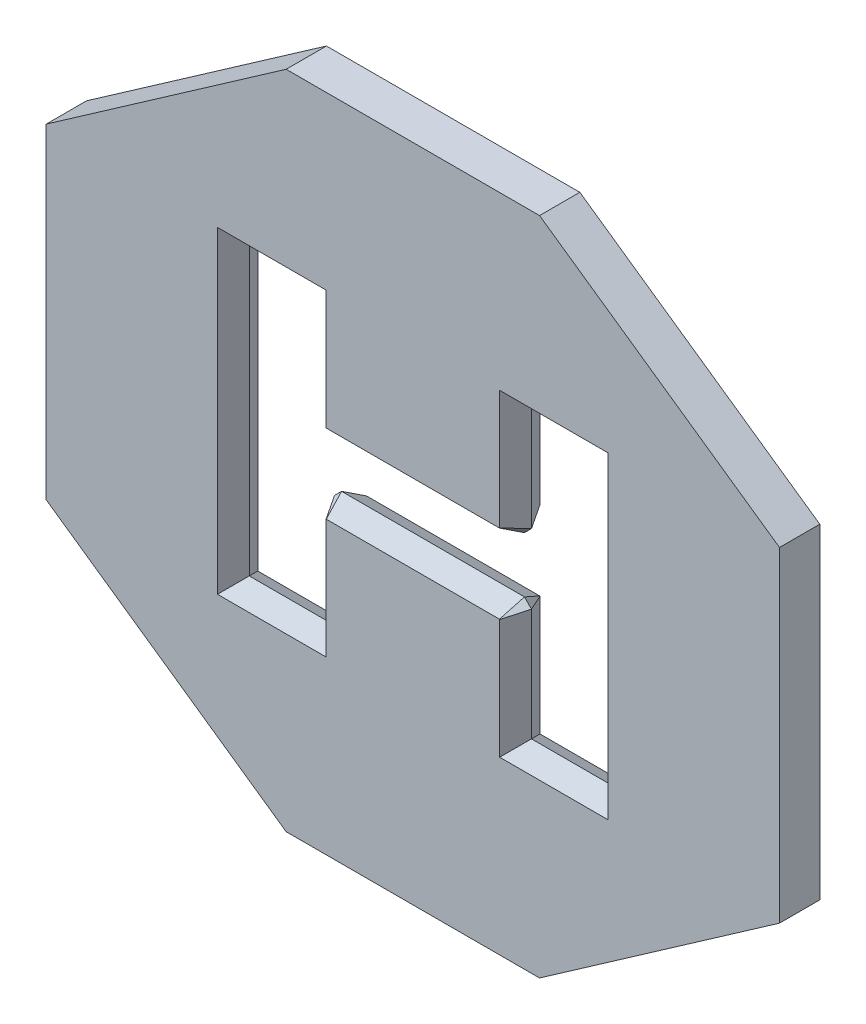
ISO-10303-21;
HEADER;
FILE_DESCRIPTION(('STEP AP214'),'2;1');
FILE_NAME('part.step','',(''),(''),'','','');
FILE_SCHEMA(('AUTOMOTIVE_DESIGN { 1 0 10303 214 1 1 1 1 }'));
ENDSEC;
DATA;
#1=APPLICATION_CONTEXT('core data for automotive mechanical design processes');
#2=APPLICATION_PROTOCOL_DEFINITION('international standard','automotive_design',2000,#1);
#3=PRODUCT_CONTEXT('',#1,'mechanical');
#4=PRODUCT('Part','Part','',(#3));
#5=PRODUCT_RELATED_PRODUCT_CATEGORY('part','',(#4));
#6=PRODUCT_DEFINITION_FORMATION('','',#4);
#7=PRODUCT_DEFINITION_CONTEXT('part definition',#1,'design');
#8=PRODUCT_DEFINITION('design','',#6,#7);
#9=PRODUCT_DEFINITION_SHAPE('','',#8);
#10=(LENGTH_UNIT() NAMED_UNIT(*) SI_UNIT(.MILLI.,.METRE.));
#11=(NAMED_UNIT(*) PLANE_ANGLE_UNIT() SI_UNIT($,.RADIAN.));
#12=(NAMED_UNIT(*) SI_UNIT($,.STERADIAN.) SOLID_ANGLE_UNIT());
#13=UNCERTAINTY_MEASURE_WITH_UNIT(LENGTH_MEASURE(1.E-05),#10,'distance_accuracy_value','');
#14=(GEOMETRIC_REPRESENTATION_CONTEXT(3) GLOBAL_UNCERTAINTY_ASSIGNED_CONTEXT((#13)) GLOBAL_UNIT_ASSIGNED_CONTEXT((#10,
#11,#12)) REPRESENTATION_CONTEXT('',''));
#15=CARTESIAN_POINT('',(0.,0.,0.));
#16=DIRECTION('',(0.,0.,1.));
#17=DIRECTION('',(1.,0.,0.));
#18=AXIS2_PLACEMENT_3D('',#15,#16,#17);
#19=CARTESIAN_POINT('',(-2.8421709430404E-11,2.8421709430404E-11,31.7500000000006));
#20=DIRECTION('',(0.,0.,-1.));
#21=DIRECTION('',(-1.,0.,0.));
#22=AXIS2_PLACEMENT_3D('',#19,#20,#21);
#23=PLANE('',#22);
#24=DIRECTION('',(-1.,0.,0.));
#25=VECTOR('',#24,1.);
#26=CARTESIAN_POINT('',(156.845000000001,-250.377999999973,31.7499999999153));
#27=LINE('',#26,#25);
#28=CARTESIAN_POINT('',(307.908999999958,-250.377999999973,31.7500000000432));
#29=VERTEX_POINT('',#28);
#30=CARTESIAN_POINT('',(136.844999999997,-250.377999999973,31.7499999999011));
#31=VERTEX_POINT('',#30);
#32=EDGE_CURVE('E339',#29,#31,#27,.T.);
#33=ORIENTED_EDGE('',*,*,#32,.T.);
#34=DIRECTION('',(0.,1.,0.));
#35=VECTOR('',#34,1.);
#36=CARTESIAN_POINT('',(136.844999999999,-54.2289999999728,31.7499999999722));
#37=LINE('',#36,#35);
#38=CARTESIAN_POINT('',(136.844999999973,-62.5132712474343,31.7499999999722));
#39=VERTEX_POINT('',#38);
#40=EDGE_CURVE('E345',#31,#39,#37,.T.);
#41=ORIENTED_EDGE('',*,*,#40,.T.);
#42=DIRECTION('',(-0.707106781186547,0.707106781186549,0.));
#43=VECTOR('',#42,1.);
#44=CARTESIAN_POINT('',(130.637864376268,-56.3061356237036,31.7499999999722));
#45=LINE('',#44,#43);
#46=CARTESIAN_POINT('',(136.495728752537,-62.1639999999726,31.7499999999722));
#47=VERTEX_POINT('',#46);
#48=EDGE_CURVE('E284',#39,#47,#45,.T.);
#49=ORIENTED_EDGE('',*,*,#48,.T.);
#50=DIRECTION('',(-1.,0.,0.));
#51=VECTOR('',#50,1.);
#52=CARTESIAN_POINT('',(-144.780000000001,-62.1639999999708,31.7499999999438));
#53=LINE('',#52,#51);
#54=CARTESIAN_POINT('',(-136.495728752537,-62.1639999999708,31.749999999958));
#55=VERTEX_POINT('',#54);
#56=EDGE_CURVE('E289',#47,#55,#53,.T.);
#57=ORIENTED_EDGE('',*,*,#56,.T.);
#58=DIRECTION('',(-0.707106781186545,-0.70710678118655,0.));
#59=VECTOR('',#58,1.);
#60=CARTESIAN_POINT('',(-142.702864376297,-68.3711356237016,31.7499999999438));
#61=LINE('',#60,#59);
#62=CARTESIAN_POINT('',(-136.845000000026,-62.5132712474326,31.749999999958));
#63=VERTEX_POINT('',#62);
#64=EDGE_CURVE('E296',#55,#63,#61,.T.);
#65=ORIENTED_EDGE('',*,*,#64,.T.);
#66=DIRECTION('',(0.,-1.,0.));
#67=VECTOR('',#66,1.);
#68=CARTESIAN_POINT('',(-136.845000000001,-230.377999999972,31.7500000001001));
#69=LINE('',#68,#67);
#70=CARTESIAN_POINT('',(-136.845000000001,-250.377999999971,31.7500000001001));
#71=VERTEX_POINT('',#70);
#72=EDGE_CURVE('E302',#63,#71,#69,.T.);
#73=ORIENTED_EDGE('',*,*,#72,.T.);
#74=DIRECTION('',(-1.,0.,0.));
#75=VECTOR('',#74,1.);
#76=CARTESIAN_POINT('',(-287.909000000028,-250.377999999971,31.7499999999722));
#77=LINE('',#76,#75);
#78=CARTESIAN_POINT('',(-307.909000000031,-250.377999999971,31.749999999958));
#79=VERTEX_POINT('',#78);
#80=EDGE_CURVE('E308',#71,#79,#77,.T.);
#81=ORIENTED_EDGE('',*,*,#80,.T.);
#82=DIRECTION('',(0.,1.,0.));
#83=VECTOR('',#82,1.);
#84=CARTESIAN_POINT('',(-307.909000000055,230.37800000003,31.750000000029));
#85=LINE('',#84,#83);
#86=CARTESIAN_POINT('',(-307.909000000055,250.37800000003,31.749999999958));
#87=VERTEX_POINT('',#86);
#88=EDGE_CURVE('E307',#79,#87,#85,.T.);
#89=ORIENTED_EDGE('',*,*,#88,.T.);
#90=DIRECTION('',(1.,0.,0.));
#91=VECTOR('',#90,1.);
#92=CARTESIAN_POINT('',(-156.845000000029,250.37800000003,31.7500000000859));
#93=LINE('',#92,#91);
#94=CARTESIAN_POINT('',(-136.845000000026,250.37800000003,31.7500000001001));
#95=VERTEX_POINT('',#94);
#96=EDGE_CURVE('E312',#87,#95,#93,.T.);
#97=ORIENTED_EDGE('',*,*,#96,.T.);
#98=DIRECTION('',(0.,-1.,0.));
#99=VECTOR('',#98,1.);
#100=CARTESIAN_POINT('',(-136.845000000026,54.2290000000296,31.7500000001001));
#101=LINE('',#100,#99);
#102=CARTESIAN_POINT('',(-136.844999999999,62.5132712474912,31.7500000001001));
#103=VERTEX_POINT('',#102);
#104=EDGE_CURVE('E318',#95,#103,#101,.T.);
#105=ORIENTED_EDGE('',*,*,#104,.T.);
#106=DIRECTION('',(0.707106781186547,-0.707106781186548,0.));
#107=VECTOR('',#106,1.);
#108=CARTESIAN_POINT('',(-130.637864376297,56.3061356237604,31.7500000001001));
#109=LINE('',#108,#107);
#110=CARTESIAN_POINT('',(-136.495728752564,62.1640000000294,31.7500000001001));
#111=VERTEX_POINT('',#110);
#112=EDGE_CURVE('E321',#103,#111,#109,.T.);
#113=ORIENTED_EDGE('',*,*,#112,.T.);
#114=DIRECTION('',(1.,0.,0.));
#115=VECTOR('',#114,1.);
#116=CARTESIAN_POINT('',(144.779999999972,62.1640000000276,31.7500000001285));
#117=LINE('',#116,#115);
#118=CARTESIAN_POINT('',(136.495728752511,62.1640000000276,31.7500000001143));
#119=VERTEX_POINT('',#118);
#120=EDGE_CURVE('E323',#111,#119,#117,.T.);
#121=ORIENTED_EDGE('',*,*,#120,.T.);
#122=DIRECTION('',(0.707106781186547,0.707106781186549,0.));
#123=VECTOR('',#122,1.);
#124=CARTESIAN_POINT('',(142.702864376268,68.3711356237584,31.7500000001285));
#125=LINE('',#124,#123);
#126=CARTESIAN_POINT('',(136.844999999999,62.5132712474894,31.7500000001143));
#127=VERTEX_POINT('',#126);
#128=EDGE_CURVE('E330',#119,#127,#125,.T.);
#129=ORIENTED_EDGE('',*,*,#128,.T.);
#130=DIRECTION('',(0.,1.,0.));
#131=VECTOR('',#130,1.);
#132=CARTESIAN_POINT('',(136.844999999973,230.378000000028,31.7499999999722));
#133=LINE('',#132,#131);
#134=CARTESIAN_POINT('',(136.844999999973,250.378000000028,31.7499999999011));
#135=VERTEX_POINT('',#134);
#136=EDGE_CURVE('E328',#127,#135,#133,.T.);
#137=ORIENTED_EDGE('',*,*,#136,.T.);
#138=DIRECTION('',(1.,0.,0.));
#139=VECTOR('',#138,1.);
#140=CARTESIAN_POINT('',(287.908999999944,250.378000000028,31.750000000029));
#141=LINE('',#140,#139);
#142=CARTESIAN_POINT('',(307.908999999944,250.378000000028,31.7500000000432));
#143=VERTEX_POINT('',#142);
#144=EDGE_CURVE('E333',#135,#143,#141,.T.);
#145=ORIENTED_EDGE('',*,*,#144,.T.);
#146=DIRECTION('',(0.,-1.,0.));
#147=VECTOR('',#146,1.);
#148=CARTESIAN_POINT('',(307.908999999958,-230.377999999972,31.7500000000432));
#149=LINE('',#148,#147);
#150=EDGE_CURVE('E337',#143,#29,#149,.T.);
#151=ORIENTED_EDGE('',*,*,#150,.T.);
#152=EDGE_LOOP('',(#33,#41,#49,#57,#65,#73,#81,#89,#97,#105,#113,#121,#129,#137,#145,#151));
#153=FACE_BOUND('',#152,.T.);
#154=DIRECTION('',(0.,-1.,0.));
#155=VECTOR('',#154,1.);
#156=CARTESIAN_POINT('',(-577.830268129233,-256.384950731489,31.7499999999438));
#157=LINE('',#156,#155);
#158=CARTESIAN_POINT('',(-577.830268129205,256.384950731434,31.7499999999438));
#159=VERTEX_POINT('',#158);
#160=CARTESIAN_POINT('',(-577.830268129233,-256.384950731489,31.7499999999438));
#161=VERTEX_POINT('',#160);
#162=EDGE_CURVE('E268',#159,#161,#157,.T.);
#163=ORIENTED_EDGE('',*,*,#162,.T.);
#164=DIRECTION('',(0.820038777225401,-0.572307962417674,0.));
#165=VECTOR('',#164,1.);
#166=CARTESIAN_POINT('',(-199.677265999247,-520.29926812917,31.7500000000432));
#167=LINE('',#166,#165);
#168=CARTESIAN_POINT('',(-199.677265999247,-520.29926812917,31.7500000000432));
#169=VERTEX_POINT('',#168);
#170=EDGE_CURVE('E258',#161,#169,#167,.T.);
#171=ORIENTED_EDGE('',*,*,#170,.T.);
#172=DIRECTION('',(1.,0.,0.));
#173=VECTOR('',#172,1.);
#174=CARTESIAN_POINT('',(199.677265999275,-520.299268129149,31.749999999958));
#175=LINE('',#174,#173);
#176=CARTESIAN_POINT('',(199.677265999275,-520.299268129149,31.749999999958));
#177=VERTEX_POINT('',#176);
#178=EDGE_CURVE('E270',#169,#177,#175,.T.);
#179=ORIENTED_EDGE('',*,*,#178,.T.);
#180=DIRECTION('',(0.820038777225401,0.572307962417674,0.));
#181=VECTOR('',#180,1.);
#182=CARTESIAN_POINT('',(577.830268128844,-256.384950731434,31.7500000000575));
#183=LINE('',#182,#181);
#184=CARTESIAN_POINT('',(577.830268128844,-256.384950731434,31.7500000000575));
#185=VERTEX_POINT('',#184);
#186=EDGE_CURVE('E1061',#177,#185,#183,.T.);
#187=ORIENTED_EDGE('',*,*,#186,.T.);
#188=DIRECTION('',(0.,1.,0.));
#189=VECTOR('',#188,1.);
#190=CARTESIAN_POINT('',(577.83026812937,256.384950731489,31.7500000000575));
#191=LINE('',#190,#189);
#192=CARTESIAN_POINT('',(577.83026812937,256.384950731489,31.7500000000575));
#193=VERTEX_POINT('',#192);
#194=EDGE_CURVE('E1101',#185,#193,#191,.T.);
#195=ORIENTED_EDGE('',*,*,#194,.T.);
#196=DIRECTION('',(-0.820038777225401,0.572307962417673,0.));
#197=VECTOR('',#196,1.);
#198=CARTESIAN_POINT('',(199.677265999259,520.299268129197,31.749999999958));
#199=LINE('',#198,#197);
#200=CARTESIAN_POINT('',(199.677265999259,520.299268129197,31.749999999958));
#201=VERTEX_POINT('',#200);
#202=EDGE_CURVE('E1108',#193,#201,#199,.T.);
#203=ORIENTED_EDGE('',*,*,#202,.T.);
#204=DIRECTION('',(-1.,0.,0.));
#205=VECTOR('',#204,1.);
#206=CARTESIAN_POINT('',(-199.677265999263,520.299268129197,31.7500000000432));
#207=LINE('',#206,#205);
#208=CARTESIAN_POINT('',(-199.677265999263,520.299268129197,31.7500000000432));
#209=VERTEX_POINT('',#208);
#210=EDGE_CURVE('E1113',#201,#209,#207,.T.);
#211=ORIENTED_EDGE('',*,*,#210,.T.);
#212=DIRECTION('',(-0.8200387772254,-0.572307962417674,0.));
#213=VECTOR('',#212,1.);
#214=CARTESIAN_POINT('',(-577.830268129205,256.384950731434,31.7499999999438));
#215=LINE('',#214,#213);
#216=EDGE_CURVE('E275',#209,#159,#215,.T.);
#217=ORIENTED_EDGE('',*,*,#216,.T.);
#218=EDGE_LOOP('',(#163,#171,#179,#187,#195,#203,#211,#217));
#219=FACE_BOUND('',#218,.T.);
#220=ADVANCED_FACE('F42',(#153,#219),#23,.F.);
#221=CARTESIAN_POINT('',(0.,-2.8421709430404E-11,-31.7500000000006));
#222=DIRECTION('',(0.,0.,-1.));
#223=DIRECTION('',(-1.,0.,0.));
#224=AXIS2_PLACEMENT_3D('',#221,#222,#223);
#225=PLANE('',#224);
#226=DIRECTION('',(0.,1.,0.));
#227=VECTOR('',#226,1.);
#228=CARTESIAN_POINT('',(-136.844999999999,-2.8421709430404E-11,-31.7499999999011));
#229=LINE('',#228,#227);
#230=CARTESIAN_POINT('',(-136.844999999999,-250.378000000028,-31.7499999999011));
#231=VERTEX_POINT('',#230);
#232=CARTESIAN_POINT('',(-136.844999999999,-62.5132712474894,-31.7500000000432));
#233=VERTEX_POINT('',#232);
#234=EDGE_CURVE('E441',#231,#233,#229,.T.);
#235=ORIENTED_EDGE('',*,*,#234,.T.);
#236=DIRECTION('',(0.707106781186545,0.70710678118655,0.));
#237=VECTOR('',#236,1.);
#238=CARTESIAN_POINT('',(-37.16586437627,37.1658643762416,-31.750000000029));
#239=LINE('',#238,#237);
#240=CARTESIAN_POINT('',(-136.495728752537,-62.1640000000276,-31.7500000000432));
#241=VERTEX_POINT('',#240);
#242=EDGE_CURVE('E446',#233,#241,#239,.T.);
#243=ORIENTED_EDGE('',*,*,#242,.T.);
#244=DIRECTION('',(1.,0.,0.));
#245=VECTOR('',#244,1.);
#246=CARTESIAN_POINT('',(0.,-62.1640000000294,-31.7499999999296));
#247=LINE('',#246,#245);
#248=CARTESIAN_POINT('',(136.495728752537,-62.1640000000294,-31.750000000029));
#249=VERTEX_POINT('',#248);
#250=EDGE_CURVE('E348',#241,#249,#247,.T.);
#251=ORIENTED_EDGE('',*,*,#250,.T.);
#252=DIRECTION('',(0.707106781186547,-0.707106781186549,0.));
#253=VECTOR('',#252,1.);
#254=CARTESIAN_POINT('',(37.16586437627,37.1658643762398,-31.7499999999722));
#255=LINE('',#254,#253);
#256=CARTESIAN_POINT('',(136.844999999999,-62.5132712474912,-31.750000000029));
#257=VERTEX_POINT('',#256);
#258=EDGE_CURVE('E402',#249,#257,#255,.T.);
#259=ORIENTED_EDGE('',*,*,#258,.T.);
#260=DIRECTION('',(0.,-1.,0.));
#261=VECTOR('',#260,1.);
#262=CARTESIAN_POINT('',(136.844999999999,-2.8421709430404E-11,-31.7500000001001));
#263=LINE('',#262,#261);
#264=CARTESIAN_POINT('',(136.844999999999,-250.37800000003,-31.7500000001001));
#265=VERTEX_POINT('',#264);
#266=EDGE_CURVE('E410',#257,#265,#263,.T.);
#267=ORIENTED_EDGE('',*,*,#266,.T.);
#268=DIRECTION('',(1.,0.,0.));
#269=VECTOR('',#268,1.);
#270=CARTESIAN_POINT('',(0.,-250.378000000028,-31.7500000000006));
#271=LINE('',#270,#269);
#272=CARTESIAN_POINT('',(307.908999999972,-250.37800000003,-31.749999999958));
#273=VERTEX_POINT('',#272);
#274=EDGE_CURVE('E409',#265,#273,#271,.T.);
#275=ORIENTED_EDGE('',*,*,#274,.T.);
#276=DIRECTION('',(0.,1.,0.));
#277=VECTOR('',#276,1.);
#278=CARTESIAN_POINT('',(307.908999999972,-2.8421709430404E-11,-31.749999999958));
#279=LINE('',#278,#277);
#280=CARTESIAN_POINT('',(307.908999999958,250.377999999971,-31.749999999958));
#281=VERTEX_POINT('',#280);
#282=EDGE_CURVE('E412',#273,#281,#279,.T.);
#283=ORIENTED_EDGE('',*,*,#282,.T.);
#284=DIRECTION('',(-1.,0.,0.));
#285=VECTOR('',#284,1.);
#286=CARTESIAN_POINT('',(-1.77635683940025E-11,250.377999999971,-31.7500000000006));
#287=LINE('',#286,#285);
#288=CARTESIAN_POINT('',(136.844999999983,250.377999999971,-31.7500000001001));
#289=VERTEX_POINT('',#288);
#290=EDGE_CURVE('E417',#281,#289,#287,.T.);
#291=ORIENTED_EDGE('',*,*,#290,.T.);
#292=DIRECTION('',(0.,-1.,0.));
#293=VECTOR('',#292,1.);
#294=CARTESIAN_POINT('',(136.844999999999,-2.8421709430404E-11,-31.7500000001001));
#295=LINE('',#294,#293);
#296=CARTESIAN_POINT('',(136.844999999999,62.5132712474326,-31.7499999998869));
#297=VERTEX_POINT('',#296);
#298=EDGE_CURVE('E416',#289,#297,#295,.T.);
#299=ORIENTED_EDGE('',*,*,#298,.T.);
#300=DIRECTION('',(-0.707106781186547,-0.707106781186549,0.));
#301=VECTOR('',#300,1.);
#302=CARTESIAN_POINT('',(37.1658643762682,-37.1658643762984,-31.7499999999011));
#303=LINE('',#302,#301);
#304=CARTESIAN_POINT('',(136.495728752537,62.1639999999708,-31.7499999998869));
#305=VERTEX_POINT('',#304);
#306=EDGE_CURVE('E425',#297,#305,#303,.T.);
#307=ORIENTED_EDGE('',*,*,#306,.T.);
#308=DIRECTION('',(-1.,0.,0.));
#309=VECTOR('',#308,1.);
#310=CARTESIAN_POINT('',(0.,62.1639999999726,-31.7500000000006));
#311=LINE('',#310,#309);
#312=CARTESIAN_POINT('',(-136.495728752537,62.1639999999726,-31.7499999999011));
#313=VERTEX_POINT('',#312);
#314=EDGE_CURVE('E421',#305,#313,#311,.T.);
#315=ORIENTED_EDGE('',*,*,#314,.T.);
#316=DIRECTION('',(-0.707106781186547,0.707106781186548,0.));
#317=VECTOR('',#316,1.);
#318=CARTESIAN_POINT('',(-37.1658643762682,-37.1658643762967,-31.749999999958));
#319=LINE('',#318,#317);
#320=CARTESIAN_POINT('',(-136.844999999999,62.5132712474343,-31.7499999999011));
#321=VERTEX_POINT('',#320);
#322=EDGE_CURVE('E426',#313,#321,#319,.T.);
#323=ORIENTED_EDGE('',*,*,#322,.T.);
#324=DIRECTION('',(0.,1.,0.));
#325=VECTOR('',#324,1.);
#326=CARTESIAN_POINT('',(-136.844999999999,-2.8421709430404E-11,-31.7499999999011));
#327=LINE('',#326,#325);
#328=CARTESIAN_POINT('',(-136.845000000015,250.377999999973,-31.7499999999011));
#329=VERTEX_POINT('',#328);
#330=EDGE_CURVE('E433',#321,#329,#327,.T.);
#331=ORIENTED_EDGE('',*,*,#330,.T.);
#332=DIRECTION('',(-1.,0.,0.));
#333=VECTOR('',#332,1.);
#334=CARTESIAN_POINT('',(-1.77635683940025E-11,250.377999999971,-31.7500000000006));
#335=LINE('',#334,#333);
#336=CARTESIAN_POINT('',(-307.909000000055,250.377999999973,-31.7500000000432));
#337=VERTEX_POINT('',#336);
#338=EDGE_CURVE('E432',#329,#337,#335,.T.);
#339=ORIENTED_EDGE('',*,*,#338,.T.);
#340=DIRECTION('',(0.,-1.,0.));
#341=VECTOR('',#340,1.);
#342=CARTESIAN_POINT('',(-307.909000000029,-2.8421709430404E-11,-31.7500000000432));
#343=LINE('',#342,#341);
#344=CARTESIAN_POINT('',(-307.909000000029,-250.378000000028,-31.7500000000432));
#345=VERTEX_POINT('',#344);
#346=EDGE_CURVE('E437',#337,#345,#343,.T.);
#347=ORIENTED_EDGE('',*,*,#346,.T.);
#348=DIRECTION('',(1.,0.,0.));
#349=VECTOR('',#348,1.);
#350=CARTESIAN_POINT('',(0.,-250.378000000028,-31.7500000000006));
#351=LINE('',#350,#349);
#352=EDGE_CURVE('E439',#345,#231,#351,.T.);
#353=ORIENTED_EDGE('',*,*,#352,.T.);
#354=EDGE_LOOP('',(#235,#243,#251,#259,#267,#275,#283,#291,#299,#307,#315,#323,#331,#339,#347,#353));
#355=FACE_BOUND('',#354,.T.);
#356=DIRECTION('',(0.,-1.,0.));
#357=VECTOR('',#356,1.);
#358=CARTESIAN_POINT('',(-577.830268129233,-256.384950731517,-31.7500000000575));
#359=LINE('',#358,#357);
#360=CARTESIAN_POINT('',(-577.830268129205,256.384950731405,-31.7500000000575));
#361=VERTEX_POINT('',#360);
#362=CARTESIAN_POINT('',(-577.830268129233,-256.384950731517,-31.7500000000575));
#363=VERTEX_POINT('',#362);
#364=EDGE_CURVE('E282',#361,#363,#359,.T.);
#365=ORIENTED_EDGE('',*,*,#364,.F.);
#366=DIRECTION('',(-0.8200387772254,-0.572307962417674,0.));
#367=VECTOR('',#366,1.);
#368=CARTESIAN_POINT('',(-577.830268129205,256.384950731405,-31.7500000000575));
#369=LINE('',#368,#367);
#370=CARTESIAN_POINT('',(-199.677265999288,520.29926812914,-31.749999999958));
#371=VERTEX_POINT('',#370);
#372=EDGE_CURVE('E280',#371,#361,#369,.T.);
#373=ORIENTED_EDGE('',*,*,#372,.F.);
#374=DIRECTION('',(-1.,0.,0.));
#375=VECTOR('',#374,1.);
#376=CARTESIAN_POINT('',(-199.677265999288,520.29926812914,-31.749999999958));
#377=LINE('',#376,#375);
#378=CARTESIAN_POINT('',(199.677265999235,520.29926812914,-31.7500000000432));
#379=VERTEX_POINT('',#378);
#380=EDGE_CURVE('E1077',#379,#371,#377,.T.);
#381=ORIENTED_EDGE('',*,*,#380,.F.);
#382=DIRECTION('',(-0.820038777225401,0.572307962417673,0.));
#383=VECTOR('',#382,1.);
#384=CARTESIAN_POINT('',(199.677265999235,520.29926812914,-31.7500000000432));
#385=LINE('',#384,#383);
#386=CARTESIAN_POINT('',(577.830268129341,256.38495073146,-31.7499999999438));
#387=VERTEX_POINT('',#386);
#388=EDGE_CURVE('E1071',#387,#379,#385,.T.);
#389=ORIENTED_EDGE('',*,*,#388,.F.);
#390=DIRECTION('',(0.,1.,0.));
#391=VECTOR('',#390,1.);
#392=CARTESIAN_POINT('',(577.830268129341,256.38495073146,-31.7499999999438));
#393=LINE('',#392,#391);
#394=CARTESIAN_POINT('',(577.830268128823,-256.384950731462,-31.7499999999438));
#395=VERTEX_POINT('',#394);
#396=EDGE_CURVE('E1066',#395,#387,#393,.T.);
#397=ORIENTED_EDGE('',*,*,#396,.F.);
#398=DIRECTION('',(0.820038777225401,0.572307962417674,0.));
#399=VECTOR('',#398,1.);
#400=CARTESIAN_POINT('',(577.830268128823,-256.384950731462,-31.7499999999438));
#401=LINE('',#400,#399);
#402=CARTESIAN_POINT('',(199.677265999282,-520.299268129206,-31.7500000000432));
#403=VERTEX_POINT('',#402);
#404=EDGE_CURVE('E1056',#403,#395,#401,.T.);
#405=ORIENTED_EDGE('',*,*,#404,.F.);
#406=DIRECTION('',(1.,0.,0.));
#407=VECTOR('',#406,1.);
#408=CARTESIAN_POINT('',(199.677265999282,-520.299268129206,-31.7500000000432));
#409=LINE('',#408,#407);
#410=CARTESIAN_POINT('',(-199.67726599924,-520.299268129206,-31.749999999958));
#411=VERTEX_POINT('',#410);
#412=EDGE_CURVE('E1053',#411,#403,#409,.T.);
#413=ORIENTED_EDGE('',*,*,#412,.F.);
#414=DIRECTION('',(0.820038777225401,-0.572307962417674,0.));
#415=VECTOR('',#414,1.);
#416=CARTESIAN_POINT('',(-199.67726599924,-520.299268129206,-31.749999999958));
#417=LINE('',#416,#415);
#418=EDGE_CURVE('E1059',#363,#411,#417,.T.);
#419=ORIENTED_EDGE('',*,*,#418,.F.);
#420=EDGE_LOOP('',(#365,#373,#381,#389,#397,#405,#413,#419));
#421=FACE_BOUND('',#420,.T.);
#422=ADVANCED_FACE('F596',(#355,#421),#225,.T.);
#423=CARTESIAN_POINT('',(-577.830268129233,-256.384950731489,31.7499999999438));
#424=DIRECTION('',(1.,0.,0.));
#425=DIRECTION('',(0.,0.,-1.));
#426=AXIS2_PLACEMENT_3D('',#423,#424,#425);
#427=PLANE('',#426);
#428=ORIENTED_EDGE('',*,*,#364,.T.);
#429=DIRECTION('',(0.,0.,-1.));
#430=VECTOR('',#429,1.);
#431=CARTESIAN_POINT('',(-577.830268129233,-256.384950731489,31.7499999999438));
#432=LINE('',#431,#430);
#433=EDGE_CURVE('E259',#161,#363,#432,.T.);
#434=ORIENTED_EDGE('',*,*,#433,.F.);
#435=ORIENTED_EDGE('',*,*,#162,.F.);
#436=DIRECTION('',(0.,0.,-1.));
#437=VECTOR('',#436,1.);
#438=CARTESIAN_POINT('',(-577.830268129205,256.384950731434,31.7499999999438));
#439=LINE('',#438,#437);
#440=EDGE_CURVE('E1082',#159,#361,#439,.T.);
#441=ORIENTED_EDGE('',*,*,#440,.T.);
#442=EDGE_LOOP('',(#428,#434,#435,#441));
#443=FACE_BOUND('',#442,.T.);
#444=ADVANCED_FACE('F278',(#443),#427,.F.);
#445=CARTESIAN_POINT('',(-199.677265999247,-520.29926812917,31.7500000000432));
#446=DIRECTION('',(0.572307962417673,0.820038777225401,0.));
#447=DIRECTION('',(-0.820038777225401,0.572307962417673,0.));
#448=AXIS2_PLACEMENT_3D('',#445,#446,#447);
#449=PLANE('',#448);
#450=ORIENTED_EDGE('',*,*,#418,.T.);
#451=DIRECTION('',(0.,0.,-1.));
#452=VECTOR('',#451,1.);
#453=CARTESIAN_POINT('',(-199.677265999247,-520.29926812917,31.7500000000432));
#454=LINE('',#453,#452);
#455=EDGE_CURVE('E261',#169,#411,#454,.T.);
#456=ORIENTED_EDGE('',*,*,#455,.F.);
#457=ORIENTED_EDGE('',*,*,#170,.F.);
#458=ORIENTED_EDGE('',*,*,#433,.T.);
#459=EDGE_LOOP('',(#450,#456,#457,#458));
#460=FACE_BOUND('',#459,.T.);
#461=ADVANCED_FACE('F256',(#460),#449,.F.);
#462=CARTESIAN_POINT('',(199.677265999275,-520.299268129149,31.749999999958));
#463=DIRECTION('',(0.,1.,0.));
#464=DIRECTION('',(0.,0.,1.));
#465=AXIS2_PLACEMENT_3D('',#462,#463,#464);
#466=PLANE('',#465);
#467=ORIENTED_EDGE('',*,*,#412,.T.);
#468=DIRECTION('',(0.,0.,-1.));
#469=VECTOR('',#468,1.);
#470=CARTESIAN_POINT('',(199.677265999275,-520.299268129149,31.749999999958));
#471=LINE('',#470,#469);
#472=EDGE_CURVE('E292',#177,#403,#471,.T.);
#473=ORIENTED_EDGE('',*,*,#472,.F.);
#474=ORIENTED_EDGE('',*,*,#178,.F.);
#475=ORIENTED_EDGE('',*,*,#455,.T.);
#476=EDGE_LOOP('',(#467,#473,#474,#475));
#477=FACE_BOUND('',#476,.T.);
#478=ADVANCED_FACE('F727',(#477),#466,.F.);
#479=CARTESIAN_POINT('',(577.830268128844,-256.384950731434,31.7500000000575));
#480=DIRECTION('',(-0.572307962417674,0.820038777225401,0.));
#481=DIRECTION('',(-0.820038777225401,-0.572307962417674,0.));
#482=AXIS2_PLACEMENT_3D('',#479,#480,#481);
#483=PLANE('',#482);
#484=ORIENTED_EDGE('',*,*,#404,.T.);
#485=DIRECTION('',(0.,0.,-1.));
#486=VECTOR('',#485,1.);
#487=CARTESIAN_POINT('',(577.830268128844,-256.384950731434,31.7500000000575));
#488=LINE('',#487,#486);
#489=EDGE_CURVE('E1064',#185,#395,#488,.T.);
#490=ORIENTED_EDGE('',*,*,#489,.F.);
#491=ORIENTED_EDGE('',*,*,#186,.F.);
#492=ORIENTED_EDGE('',*,*,#472,.T.);
#493=EDGE_LOOP('',(#484,#490,#491,#492));
#494=FACE_BOUND('',#493,.T.);
#495=ADVANCED_FACE('F722',(#494),#483,.F.);
#496=CARTESIAN_POINT('',(577.83026812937,256.384950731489,31.7500000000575));
#497=DIRECTION('',(-1.,0.,0.));
#498=DIRECTION('',(0.,-1.,0.));
#499=AXIS2_PLACEMENT_3D('',#496,#497,#498);
#500=PLANE('',#499);
#501=ORIENTED_EDGE('',*,*,#396,.T.);
#502=DIRECTION('',(0.,0.,-1.));
#503=VECTOR('',#502,1.);
#504=CARTESIAN_POINT('',(577.83026812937,256.384950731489,31.7500000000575));
#505=LINE('',#504,#503);
#506=EDGE_CURVE('E1093',#193,#387,#505,.T.);
#507=ORIENTED_EDGE('',*,*,#506,.F.);
#508=ORIENTED_EDGE('',*,*,#194,.F.);
#509=ORIENTED_EDGE('',*,*,#489,.T.);
#510=EDGE_LOOP('',(#501,#507,#508,#509));
#511=FACE_BOUND('',#510,.T.);
#512=ADVANCED_FACE('F719',(#511),#500,.F.);
#513=CARTESIAN_POINT('',(199.677265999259,520.299268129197,31.749999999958));
#514=DIRECTION('',(-0.572307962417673,-0.820038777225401,0.));
#515=DIRECTION('',(0.820038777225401,-0.572307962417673,0.));
#516=AXIS2_PLACEMENT_3D('',#513,#514,#515);
#517=PLANE('',#516);
#518=ORIENTED_EDGE('',*,*,#388,.T.);
#519=DIRECTION('',(0.,0.,-1.));
#520=VECTOR('',#519,1.);
#521=CARTESIAN_POINT('',(199.677265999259,520.299268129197,31.749999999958));
#522=LINE('',#521,#520);
#523=EDGE_CURVE('E1092',#201,#379,#522,.T.);
#524=ORIENTED_EDGE('',*,*,#523,.F.);
#525=ORIENTED_EDGE('',*,*,#202,.F.);
#526=ORIENTED_EDGE('',*,*,#506,.T.);
#527=EDGE_LOOP('',(#518,#524,#525,#526));
#528=FACE_BOUND('',#527,.T.);
#529=ADVANCED_FACE('F716',(#528),#517,.F.);
#530=CARTESIAN_POINT('',(-199.677265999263,520.299268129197,31.7500000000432));
#531=DIRECTION('',(0.,-1.,0.));
#532=DIRECTION('',(0.,0.,-1.));
#533=AXIS2_PLACEMENT_3D('',#530,#531,#532);
#534=PLANE('',#533);
#535=ORIENTED_EDGE('',*,*,#380,.T.);
#536=DIRECTION('',(0.,0.,-1.));
#537=VECTOR('',#536,1.);
#538=CARTESIAN_POINT('',(-199.677265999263,520.299268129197,31.7500000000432));
#539=LINE('',#538,#537);
#540=EDGE_CURVE('E1090',#209,#371,#539,.T.);
#541=ORIENTED_EDGE('',*,*,#540,.F.);
#542=ORIENTED_EDGE('',*,*,#210,.F.);
#543=ORIENTED_EDGE('',*,*,#523,.T.);
#544=EDGE_LOOP('',(#535,#541,#542,#543));
#545=FACE_BOUND('',#544,.T.);
#546=ADVANCED_FACE('F715',(#545),#534,.F.);
#547=CARTESIAN_POINT('',(-577.830268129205,256.384950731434,31.7499999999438));
#548=DIRECTION('',(0.572307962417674,-0.8200387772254,0.));
#549=DIRECTION('',(0.8200387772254,0.572307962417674,0.));
#550=AXIS2_PLACEMENT_3D('',#547,#548,#549);
#551=PLANE('',#550);
#552=ORIENTED_EDGE('',*,*,#372,.T.);
#553=ORIENTED_EDGE('',*,*,#440,.F.);
#554=ORIENTED_EDGE('',*,*,#216,.F.);
#555=ORIENTED_EDGE('',*,*,#540,.T.);
#556=EDGE_LOOP('',(#552,#553,#554,#555));
#557=FACE_BOUND('',#556,.T.);
#558=ADVANCED_FACE('F706',(#557),#551,.F.);
#559=CARTESIAN_POINT('',(-156.845000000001,230.377999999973,-2.89101615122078));
#560=DIRECTION('',(-0.866025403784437,0.,0.500000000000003));
#561=DIRECTION('',(0.,-1.,0.));
#562=AXIS2_PLACEMENT_3D('',#559,#560,#561);
#563=PLANE('',#562);
#564=DIRECTION('',(0.44721359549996,0.44721359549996,0.774596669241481));
#565=VECTOR('',#564,1.);
#566=CARTESIAN_POINT('',(-156.845000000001,230.377999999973,-2.89101615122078));
#567=LINE('',#566,#565);
#568=CARTESIAN_POINT('',(-155.175871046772,232.047128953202,1.58095758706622E-10));
#569=VERTEX_POINT('',#568);
#570=EDGE_CURVE('E399',#569,#95,#567,.T.);
#571=ORIENTED_EDGE('',*,*,#570,.F.);
#572=DIRECTION('',(0.,1.,0.));
#573=VECTOR('',#572,1.);
#574=CARTESIAN_POINT('',(-155.175871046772,230.377999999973,1.58095758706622E-10));
#575=LINE('',#574,#573);
#576=CARTESIAN_POINT('',(-155.175871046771,54.9203758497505,8.70414851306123E-11));
#577=VERTEX_POINT('',#576);
#578=EDGE_CURVE('E467',#569,#577,#575,.F.);
#579=ORIENTED_EDGE('',*,*,#578,.T.);
#580=DIRECTION('',(0.48960977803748,0.202803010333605,0.848029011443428));
#581=VECTOR('',#580,1.);
#582=CARTESIAN_POINT('',(-139.354401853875,61.4738429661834,27.403588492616));
#583=LINE('',#582,#581);
#584=EDGE_CURVE('E394',#103,#577,#583,.F.);
#585=ORIENTED_EDGE('',*,*,#584,.F.);
#586=ORIENTED_EDGE('',*,*,#104,.F.);
#587=EDGE_LOOP('',(#571,#579,#585,#586));
#588=FACE_BOUND('',#587,.T.);
#589=ADVANCED_FACE('F713',(#588),#563,.T.);
#590=CARTESIAN_POINT('',(-287.909000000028,230.377999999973,-2.89101615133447));
#591=DIRECTION('',(0.,-0.866025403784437,0.500000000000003));
#592=DIRECTION('',(1.,0.,0.));
#593=AXIS2_PLACEMENT_3D('',#590,#591,#592);
#594=PLANE('',#593);
#595=DIRECTION('',(-0.44721359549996,0.44721359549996,0.774596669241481));
#596=VECTOR('',#595,1.);
#597=CARTESIAN_POINT('',(-287.909000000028,230.377999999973,-2.89101615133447));
#598=LINE('',#597,#596);
#599=CARTESIAN_POINT('',(-289.578128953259,232.047128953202,4.44089209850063E-11));
#600=VERTEX_POINT('',#599);
#601=EDGE_CURVE('E392',#600,#87,#598,.T.);
#602=ORIENTED_EDGE('',*,*,#601,.F.);
#603=DIRECTION('',(-1.,0.,0.));
#604=VECTOR('',#603,1.);
#605=CARTESIAN_POINT('',(-287.909000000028,232.047128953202,4.44089209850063E-11));
#606=LINE('',#605,#604);
#607=EDGE_CURVE('E464',#600,#569,#606,.F.);
#608=ORIENTED_EDGE('',*,*,#607,.T.);
#609=ORIENTED_EDGE('',*,*,#570,.T.);
#610=ORIENTED_EDGE('',*,*,#96,.F.);
#611=EDGE_LOOP('',(#602,#608,#609,#610));
#612=FACE_BOUND('',#611,.T.);
#613=ADVANCED_FACE('F683',(#612),#594,.T.);
#614=CARTESIAN_POINT('',(-144.780000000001,42.163999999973,-2.89101615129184));
#615=DIRECTION('',(-0.612372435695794,-0.612372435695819,0.500000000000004));
#616=DIRECTION('',(0.707106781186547,-0.707106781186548,0.));
#617=AXIS2_PLACEMENT_3D('',#614,#615,#616);
#618=PLANE('',#617);
#619=ORIENTED_EDGE('',*,*,#584,.T.);
#620=DIRECTION('',(-0.707106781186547,0.707106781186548,0.));
#621=VECTOR('',#620,1.);
#622=CARTESIAN_POINT('',(-143.599747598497,43.3442524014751,8.70414851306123E-11));
#623=LINE('',#622,#621);
#624=CARTESIAN_POINT('',(-144.088624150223,43.8331289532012,8.70414851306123E-11));
#625=VERTEX_POINT('',#624);
#626=EDGE_CURVE('E469',#577,#625,#623,.F.);
#627=ORIENTED_EDGE('',*,*,#626,.T.);
#628=DIRECTION('',(0.202803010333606,0.48960977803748,0.848029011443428));
#629=VECTOR('',#628,1.);
#630=CARTESIAN_POINT('',(-144.780000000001,42.163999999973,-2.89101615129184));
#631=LINE('',#630,#629);
#632=EDGE_CURVE('E386',#111,#625,#631,.F.);
#633=ORIENTED_EDGE('',*,*,#632,.F.);
#634=ORIENTED_EDGE('',*,*,#112,.F.);
#635=EDGE_LOOP('',(#619,#627,#633,#634));
#636=FACE_BOUND('',#635,.T.);
#637=ADVANCED_FACE('F584',(#636),#618,.T.);
#638=CARTESIAN_POINT('',(-287.909000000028,-230.378000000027,-2.89101615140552));
#639=DIRECTION('',(0.866025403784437,0.,0.500000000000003));
#640=DIRECTION('',(0.,1.,0.));
#641=AXIS2_PLACEMENT_3D('',#638,#639,#640);
#642=PLANE('',#641);
#643=DIRECTION('',(-0.447213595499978,-0.44721359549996,0.774596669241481));
#644=VECTOR('',#643,1.);
#645=CARTESIAN_POINT('',(-287.909000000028,-230.378000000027,-2.89101615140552));
#646=LINE('',#645,#644);
#647=CARTESIAN_POINT('',(-289.578128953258,-232.047128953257,-2.66453525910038E-11));
#648=VERTEX_POINT('',#647);
#649=EDGE_CURVE('E383',#648,#79,#646,.T.);
#650=ORIENTED_EDGE('',*,*,#649,.F.);
#651=DIRECTION('',(0.,-1.,0.));
#652=VECTOR('',#651,1.);
#653=CARTESIAN_POINT('',(-289.578128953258,-230.378000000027,-2.66453525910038E-11));
#654=LINE('',#653,#652);
#655=EDGE_CURVE('E459',#648,#600,#654,.F.);
#656=ORIENTED_EDGE('',*,*,#655,.T.);
#657=ORIENTED_EDGE('',*,*,#601,.T.);
#658=ORIENTED_EDGE('',*,*,#88,.F.);
#659=EDGE_LOOP('',(#650,#656,#657,#658));
#660=FACE_BOUND('',#659,.T.);
#661=ADVANCED_FACE('F677',(#660),#642,.T.);
#662=CARTESIAN_POINT('',(-144.780000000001,42.163999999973,-2.89101615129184));
#663=DIRECTION('',(0.,-0.866025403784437,0.500000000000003));
#664=DIRECTION('',(1.,0.,0.));
#665=AXIS2_PLACEMENT_3D('',#662,#663,#664);
#666=PLANE('',#665);
#667=ORIENTED_EDGE('',*,*,#632,.T.);
#668=DIRECTION('',(-1.,0.,0.));
#669=VECTOR('',#668,1.);
#670=CARTESIAN_POINT('',(-144.780000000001,43.8331289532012,8.70414851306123E-11));
#671=LINE('',#670,#669);
#672=CARTESIAN_POINT('',(144.088624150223,43.8331289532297,1.29674049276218E-10));
#673=VERTEX_POINT('',#672);
#674=EDGE_CURVE('E475',#625,#673,#671,.F.);
#675=ORIENTED_EDGE('',*,*,#674,.T.);
#676=DIRECTION('',(-0.202803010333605,0.489609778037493,0.848029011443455));
#677=VECTOR('',#676,1.);
#678=CARTESIAN_POINT('',(132.870669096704,70.9156681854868,46.908333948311));
#679=LINE('',#678,#677);
#680=EDGE_CURVE('E382',#119,#673,#679,.F.);
#681=ORIENTED_EDGE('',*,*,#680,.F.);
#682=ORIENTED_EDGE('',*,*,#120,.F.);
#683=EDGE_LOOP('',(#667,#675,#681,#682));
#684=FACE_BOUND('',#683,.T.);
#685=ADVANCED_FACE('F583',(#684),#666,.T.);
#686=CARTESIAN_POINT('',(-156.845000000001,-230.378000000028,-2.89101615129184));
#687=DIRECTION('',(0.,0.866025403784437,0.500000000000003));
#688=DIRECTION('',(-1.,0.,0.));
#689=AXIS2_PLACEMENT_3D('',#686,#687,#688);
#690=PLANE('',#689);
#691=DIRECTION('',(0.447213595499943,-0.44721359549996,0.774596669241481));
#692=VECTOR('',#691,1.);
#693=CARTESIAN_POINT('',(-156.845000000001,-230.378000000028,-2.89101615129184));
#694=LINE('',#693,#692);
#695=CARTESIAN_POINT('',(-155.175871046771,-232.047128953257,8.70414851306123E-11));
#696=VERTEX_POINT('',#695);
#697=EDGE_CURVE('E378',#696,#71,#694,.T.);
#698=ORIENTED_EDGE('',*,*,#697,.F.);
#699=DIRECTION('',(1.,0.,0.));
#700=VECTOR('',#699,1.);
#701=CARTESIAN_POINT('',(-156.845000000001,-232.047128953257,8.70414851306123E-11));
#702=LINE('',#701,#700);
#703=EDGE_CURVE('E460',#696,#648,#702,.F.);
#704=ORIENTED_EDGE('',*,*,#703,.T.);
#705=ORIENTED_EDGE('',*,*,#649,.T.);
#706=ORIENTED_EDGE('',*,*,#80,.F.);
#707=EDGE_LOOP('',(#698,#704,#705,#706));
#708=FACE_BOUND('',#707,.T.);
#709=ADVANCED_FACE('F670',(#708),#690,.T.);
#710=CARTESIAN_POINT('',(144.780000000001,42.1639999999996,-2.8910161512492));
#711=DIRECTION('',(0.612372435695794,-0.612372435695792,0.500000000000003));
#712=DIRECTION('',(0.707106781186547,0.707106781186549,0.));
#713=AXIS2_PLACEMENT_3D('',#710,#711,#712);
#714=PLANE('',#713);
#715=ORIENTED_EDGE('',*,*,#680,.T.);
#716=DIRECTION('',(-0.707106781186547,-0.707106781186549,0.));
#717=VECTOR('',#716,1.);
#718=CARTESIAN_POINT('',(143.599747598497,43.3442524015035,1.29674049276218E-10));
#719=LINE('',#718,#717);
#720=CARTESIAN_POINT('',(155.175871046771,54.9203758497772,1.29674049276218E-10));
#721=VERTEX_POINT('',#720);
#722=EDGE_CURVE('E473',#673,#721,#719,.F.);
#723=ORIENTED_EDGE('',*,*,#722,.T.);
#724=DIRECTION('',(-0.48960977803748,0.202803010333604,0.848029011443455));
#725=VECTOR('',#724,1.);
#726=CARTESIAN_POINT('',(155.150791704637,54.9307640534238,0.0434386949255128));
#727=LINE('',#726,#725);
#728=EDGE_CURVE('E371',#127,#721,#727,.F.);
#729=ORIENTED_EDGE('',*,*,#728,.F.);
#730=ORIENTED_EDGE('',*,*,#128,.F.);
#731=EDGE_LOOP('',(#715,#723,#729,#730));
#732=FACE_BOUND('',#731,.T.);
#733=ADVANCED_FACE('F567',(#732),#714,.T.);
#734=CARTESIAN_POINT('',(-156.845000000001,-54.2290000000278,-2.89101615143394));
#735=DIRECTION('',(-0.866025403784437,0.,0.500000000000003));
#736=DIRECTION('',(0.,-1.,0.));
#737=AXIS2_PLACEMENT_3D('',#734,#735,#736);
#738=PLANE('',#737);
#739=DIRECTION('',(0.489609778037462,-0.202803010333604,0.848029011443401));
#740=VECTOR('',#739,1.);
#741=CARTESIAN_POINT('',(-156.845000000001,-54.2290000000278,-2.89101615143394));
#742=LINE('',#741,#740);
#743=CARTESIAN_POINT('',(-155.175871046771,-54.9203758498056,-5.50670620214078E-11));
#744=VERTEX_POINT('',#743);
#745=EDGE_CURVE('E372',#744,#63,#742,.T.);
#746=ORIENTED_EDGE('',*,*,#745,.F.);
#747=DIRECTION('',(0.,1.,0.));
#748=VECTOR('',#747,1.);
#749=CARTESIAN_POINT('',(-155.175871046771,-54.2290000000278,-5.50670620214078E-11));
#750=LINE('',#749,#748);
#751=EDGE_CURVE('E452',#744,#696,#750,.F.);
#752=ORIENTED_EDGE('',*,*,#751,.T.);
#753=ORIENTED_EDGE('',*,*,#697,.T.);
#754=ORIENTED_EDGE('',*,*,#72,.F.);
#755=EDGE_LOOP('',(#746,#752,#753,#754));
#756=FACE_BOUND('',#755,.T.);
#757=ADVANCED_FACE('F662',(#756),#738,.T.);
#758=CARTESIAN_POINT('',(156.845000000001,54.2289999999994,-2.8910161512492));
#759=DIRECTION('',(0.866025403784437,0.,0.500000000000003));
#760=DIRECTION('',(0.,1.,0.));
#761=AXIS2_PLACEMENT_3D('',#758,#759,#760);
#762=PLANE('',#761);
#763=ORIENTED_EDGE('',*,*,#728,.T.);
#764=DIRECTION('',(0.,-1.,0.));
#765=VECTOR('',#764,1.);
#766=CARTESIAN_POINT('',(155.175871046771,54.2289999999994,1.29674049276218E-10));
#767=LINE('',#766,#765);
#768=CARTESIAN_POINT('',(155.175871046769,232.047128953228,-1.24344978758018E-11));
#769=VERTEX_POINT('',#768);
#770=EDGE_CURVE('E476',#721,#769,#767,.F.);
#771=ORIENTED_EDGE('',*,*,#770,.T.);
#772=DIRECTION('',(-0.44721359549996,0.44721359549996,0.774596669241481));
#773=VECTOR('',#772,1.);
#774=CARTESIAN_POINT('',(156.845000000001,230.378,-2.89101615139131));
#775=LINE('',#774,#773);
#776=EDGE_CURVE('E370',#135,#769,#775,.F.);
#777=ORIENTED_EDGE('',*,*,#776,.F.);
#778=ORIENTED_EDGE('',*,*,#136,.F.);
#779=EDGE_LOOP('',(#763,#771,#777,#778));
#780=FACE_BOUND('',#779,.T.);
#781=ADVANCED_FACE('F575',(#780),#762,.T.);
#782=CARTESIAN_POINT('',(-156.845000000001,-54.2290000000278,-2.89101615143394));
#783=DIRECTION('',(-0.612372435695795,0.612372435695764,0.500000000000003));
#784=DIRECTION('',(-0.707106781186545,-0.70710678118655,0.));
#785=AXIS2_PLACEMENT_3D('',#782,#783,#784);
#786=PLANE('',#785);
#787=DIRECTION('',(0.202803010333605,-0.48960977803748,0.848029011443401));
#788=VECTOR('',#787,1.);
#789=CARTESIAN_POINT('',(-132.870669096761,-70.9156681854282,46.9083339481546));
#790=LINE('',#789,#788);
#791=CARTESIAN_POINT('',(-144.088624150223,-43.8331289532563,-5.50670620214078E-11));
#792=VERTEX_POINT('',#791);
#793=EDGE_CURVE('E362',#792,#55,#790,.T.);
#794=ORIENTED_EDGE('',*,*,#793,.F.);
#795=DIRECTION('',(0.707106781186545,0.70710678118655,0.));
#796=VECTOR('',#795,1.);
#797=CARTESIAN_POINT('',(-155.664747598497,-55.4092524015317,-5.50670620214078E-11));
#798=LINE('',#797,#796);
#799=EDGE_CURVE('E449',#792,#744,#798,.F.);
#800=ORIENTED_EDGE('',*,*,#799,.T.);
#801=ORIENTED_EDGE('',*,*,#745,.T.);
#802=ORIENTED_EDGE('',*,*,#64,.F.);
#803=EDGE_LOOP('',(#794,#800,#801,#802));
#804=FACE_BOUND('',#803,.T.);
#805=ADVANCED_FACE('F649',(#804),#786,.T.);
#806=CARTESIAN_POINT('',(156.845000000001,230.378,-2.89101615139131));
#807=DIRECTION('',(0.,-0.866025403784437,0.500000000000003));
#808=DIRECTION('',(1.,0.,0.));
#809=AXIS2_PLACEMENT_3D('',#806,#807,#808);
#810=PLANE('',#809);
#811=ORIENTED_EDGE('',*,*,#776,.T.);
#812=DIRECTION('',(-1.,0.,0.));
#813=VECTOR('',#812,1.);
#814=CARTESIAN_POINT('',(156.845000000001,232.047128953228,-1.24344978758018E-11));
#815=LINE('',#814,#813);
#816=CARTESIAN_POINT('',(289.578128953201,232.047128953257,1.01252339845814E-10));
#817=VERTEX_POINT('',#816);
#818=EDGE_CURVE('E483',#769,#817,#815,.F.);
#819=ORIENTED_EDGE('',*,*,#818,.T.);
#820=DIRECTION('',(0.44721359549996,0.44721359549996,0.774596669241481));
#821=VECTOR('',#820,1.);
#822=CARTESIAN_POINT('',(287.908999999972,230.378000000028,-2.89101615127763));
#823=LINE('',#822,#821);
#824=EDGE_CURVE('E359',#143,#817,#823,.F.);
#825=ORIENTED_EDGE('',*,*,#824,.F.);
#826=ORIENTED_EDGE('',*,*,#144,.F.);
#827=EDGE_LOOP('',(#811,#819,#825,#826));
#828=FACE_BOUND('',#827,.T.);
#829=ADVANCED_FACE('F613',(#828),#810,.T.);
#830=CARTESIAN_POINT('',(144.780000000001,-42.1639999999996,-2.89101615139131));
#831=DIRECTION('',(0.,0.866025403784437,0.500000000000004));
#832=DIRECTION('',(-1.,0.,0.));
#833=AXIS2_PLACEMENT_3D('',#830,#831,#832);
#834=PLANE('',#833);
#835=DIRECTION('',(-0.202803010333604,-0.489609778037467,0.848029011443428));
#836=VECTOR('',#835,1.);
#837=CARTESIAN_POINT('',(144.078235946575,-43.8582082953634,0.0434386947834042));
#838=LINE('',#837,#836);
#839=CARTESIAN_POINT('',(144.088624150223,-43.8331289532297,-1.24344978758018E-11));
#840=VERTEX_POINT('',#839);
#841=EDGE_CURVE('E360',#840,#47,#838,.T.);
#842=ORIENTED_EDGE('',*,*,#841,.F.);
#843=DIRECTION('',(1.,0.,0.));
#844=VECTOR('',#843,1.);
#845=CARTESIAN_POINT('',(144.780000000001,-43.8331289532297,-1.24344978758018E-11));
#846=LINE('',#845,#844);
#847=EDGE_CURVE('E11',#840,#792,#846,.F.);
#848=ORIENTED_EDGE('',*,*,#847,.T.);
#849=ORIENTED_EDGE('',*,*,#793,.T.);
#850=ORIENTED_EDGE('',*,*,#56,.F.);
#851=EDGE_LOOP('',(#842,#848,#849,#850));
#852=FACE_BOUND('',#851,.T.);
#853=ADVANCED_FACE('F641',(#852),#834,.T.);
#854=CARTESIAN_POINT('',(287.908999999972,230.378000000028,-2.89101615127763));
#855=DIRECTION('',(-0.866025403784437,0.,0.500000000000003));
#856=DIRECTION('',(0.,-1.,0.));
#857=AXIS2_PLACEMENT_3D('',#854,#855,#856);
#858=PLANE('',#857);
#859=ORIENTED_EDGE('',*,*,#824,.T.);
#860=DIRECTION('',(0.,1.,0.));
#861=VECTOR('',#860,1.);
#862=CARTESIAN_POINT('',(289.578128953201,230.378000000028,1.01252339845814E-10));
#863=LINE('',#862,#861);
#864=CARTESIAN_POINT('',(289.578128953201,-232.047128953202,3.01980662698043E-11));
#865=VERTEX_POINT('',#864);
#866=EDGE_CURVE('E485',#817,#865,#863,.F.);
#867=ORIENTED_EDGE('',*,*,#866,.T.);
#868=DIRECTION('',(0.447213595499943,-0.44721359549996,0.774596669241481));
#869=VECTOR('',#868,1.);
#870=CARTESIAN_POINT('',(287.908999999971,-230.377999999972,-2.89101615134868));
#871=LINE('',#870,#869);
#872=EDGE_CURVE('E351',#29,#865,#871,.F.);
#873=ORIENTED_EDGE('',*,*,#872,.F.);
#874=ORIENTED_EDGE('',*,*,#150,.F.);
#875=EDGE_LOOP('',(#859,#867,#873,#874));
#876=FACE_BOUND('',#875,.T.);
#877=ADVANCED_FACE('F612',(#876),#858,.T.);
#878=CARTESIAN_POINT('',(156.845000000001,-54.2290000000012,-2.89101615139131));
#879=DIRECTION('',(0.612372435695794,0.612372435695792,0.500000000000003));
#880=DIRECTION('',(-0.707106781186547,0.707106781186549,0.));
#881=AXIS2_PLACEMENT_3D('',#878,#879,#880);
#882=PLANE('',#881);
#883=DIRECTION('',(0.489609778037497,0.202803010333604,-0.848029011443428));
#884=VECTOR('',#883,1.);
#885=CARTESIAN_POINT('',(156.845000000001,-54.2290000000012,-2.89101615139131));
#886=LINE('',#885,#884);
#887=CARTESIAN_POINT('',(155.175871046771,-54.9203758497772,-1.24344978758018E-11));
#888=VERTEX_POINT('',#887);
#889=EDGE_CURVE('E349',#888,#39,#886,.F.);
#890=ORIENTED_EDGE('',*,*,#889,.F.);
#891=DIRECTION('',(0.707106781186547,-0.707106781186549,0.));
#892=VECTOR('',#891,1.);
#893=CARTESIAN_POINT('',(155.664747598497,-55.4092524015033,-1.24344978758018E-11));
#894=LINE('',#893,#892);
#895=EDGE_CURVE('E54',#888,#840,#894,.F.);
#896=ORIENTED_EDGE('',*,*,#895,.T.);
#897=ORIENTED_EDGE('',*,*,#841,.T.);
#898=ORIENTED_EDGE('',*,*,#48,.F.);
#899=EDGE_LOOP('',(#890,#896,#897,#898));
#900=FACE_BOUND('',#899,.T.);
#901=ADVANCED_FACE('F746',(#900),#882,.T.);
#902=CARTESIAN_POINT('',(287.908999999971,-230.377999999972,-2.89101615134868));
#903=DIRECTION('',(0.,0.866025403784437,0.500000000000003));
#904=DIRECTION('',(-1.,0.,0.));
#905=AXIS2_PLACEMENT_3D('',#902,#903,#904);
#906=PLANE('',#905);
#907=ORIENTED_EDGE('',*,*,#872,.T.);
#908=DIRECTION('',(1.,0.,0.));
#909=VECTOR('',#908,1.);
#910=CARTESIAN_POINT('',(287.908999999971,-232.047128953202,3.01980662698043E-11));
#911=LINE('',#910,#909);
#912=CARTESIAN_POINT('',(155.175871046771,-232.04712895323,-8.34887714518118E-11));
#913=VERTEX_POINT('',#912);
#914=EDGE_CURVE('E490',#865,#913,#911,.F.);
#915=ORIENTED_EDGE('',*,*,#914,.T.);
#916=DIRECTION('',(-0.447213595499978,-0.44721359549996,0.774596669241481));
#917=VECTOR('',#916,1.);
#918=CARTESIAN_POINT('',(156.845000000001,-230.378,-2.89101615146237));
#919=LINE('',#918,#917);
#920=EDGE_CURVE('E347',#31,#913,#919,.F.);
#921=ORIENTED_EDGE('',*,*,#920,.F.);
#922=ORIENTED_EDGE('',*,*,#32,.F.);
#923=EDGE_LOOP('',(#907,#915,#921,#922));
#924=FACE_BOUND('',#923,.T.);
#925=ADVANCED_FACE('F621',(#924),#906,.T.);
#926=CARTESIAN_POINT('',(156.845000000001,-230.378,-2.89101615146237));
#927=DIRECTION('',(0.866025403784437,0.,0.500000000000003));
#928=DIRECTION('',(0.,1.,0.));
#929=AXIS2_PLACEMENT_3D('',#926,#927,#928);
#930=PLANE('',#929);
#931=ORIENTED_EDGE('',*,*,#920,.T.);
#932=DIRECTION('',(0.,-1.,0.));
#933=VECTOR('',#932,1.);
#934=CARTESIAN_POINT('',(155.175871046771,-230.378,-8.34887714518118E-11));
#935=LINE('',#934,#933);
#936=EDGE_CURVE('E68',#913,#888,#935,.F.);
#937=ORIENTED_EDGE('',*,*,#936,.T.);
#938=ORIENTED_EDGE('',*,*,#889,.T.);
#939=ORIENTED_EDGE('',*,*,#40,.F.);
#940=EDGE_LOOP('',(#931,#937,#938,#939));
#941=FACE_BOUND('',#940,.T.);
#942=ADVANCED_FACE('F619',(#941),#930,.T.);
#943=CARTESIAN_POINT('',(37.1658643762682,-37.1658643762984,-31.7499999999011));
#944=DIRECTION('',(-0.612372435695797,0.612372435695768,0.499999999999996));
#945=DIRECTION('',(-0.707106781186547,-0.707106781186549,0.));
#946=AXIS2_PLACEMENT_3D('',#943,#944,#945);
#947=PLANE('',#946);
#948=DIRECTION('',(-0.489609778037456,0.202803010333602,-0.848029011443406));
#949=VECTOR('',#948,1.);
#950=CARTESIAN_POINT('',(143.052213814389,59.942159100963,-20.9987902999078));
#951=LINE('',#950,#949);
#952=EDGE_CURVE('E550',#721,#297,#951,.T.);
#953=ORIENTED_EDGE('',*,*,#952,.F.);
#954=ORIENTED_EDGE('',*,*,#722,.F.);
#955=DIRECTION('',(-0.202803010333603,0.489609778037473,-0.848029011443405));
#956=VECTOR('',#955,1.);
#957=CARTESIAN_POINT('',(142.27327771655,48.2157629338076,-7.59094472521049));
#958=LINE('',#957,#956);
#959=EDGE_CURVE('E47',#305,#673,#958,.F.);
#960=ORIENTED_EDGE('',*,*,#959,.F.);
#961=ORIENTED_EDGE('',*,*,#306,.F.);
#962=EDGE_LOOP('',(#953,#954,#960,#961));
#963=FACE_BOUND('',#962,.T.);
#964=ADVANCED_FACE('F50',(#963),#947,.F.);
#965=CARTESIAN_POINT('',(0.,62.1639999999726,-31.7500000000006));
#966=DIRECTION('',(0.,0.866025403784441,0.499999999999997));
#967=DIRECTION('',(-1.,0.,0.));
#968=AXIS2_PLACEMENT_3D('',#965,#966,#967);
#969=PLANE('',#968);
#970=ORIENTED_EDGE('',*,*,#959,.T.);
#971=ORIENTED_EDGE('',*,*,#674,.F.);
#972=DIRECTION('',(0.202803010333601,0.48960977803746,-0.848029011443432));
#973=VECTOR('',#972,1.);
#974=CARTESIAN_POINT('',(-130.881787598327,75.7172528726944,-55.2249225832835));
#975=LINE('',#974,#973);
#976=EDGE_CURVE('E542',#313,#625,#975,.F.);
#977=ORIENTED_EDGE('',*,*,#976,.F.);
#978=ORIENTED_EDGE('',*,*,#314,.F.);
#979=EDGE_LOOP('',(#970,#971,#977,#978));
#980=FACE_BOUND('',#979,.T.);
#981=ADVANCED_FACE('F565',(#980),#969,.F.);
#982=CARTESIAN_POINT('',(136.844999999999,-2.8421709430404E-11,-31.7500000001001));
#983=DIRECTION('',(-0.866025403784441,0.,0.499999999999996));
#984=DIRECTION('',(0.,-1.,0.));
#985=AXIS2_PLACEMENT_3D('',#982,#983,#984);
#986=PLANE('',#985);
#987=ORIENTED_EDGE('',*,*,#952,.T.);
#988=ORIENTED_EDGE('',*,*,#298,.F.);
#989=DIRECTION('',(0.447213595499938,-0.447213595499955,0.774596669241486));
#990=VECTOR('',#989,1.);
#991=CARTESIAN_POINT('',(109.476000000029,277.746999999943,-79.154498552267));
#992=LINE('',#991,#990);
#993=EDGE_CURVE('E539',#769,#289,#992,.F.);
#994=ORIENTED_EDGE('',*,*,#993,.F.);
#995=ORIENTED_EDGE('',*,*,#770,.F.);
#996=EDGE_LOOP('',(#987,#988,#994,#995));
#997=FACE_BOUND('',#996,.T.);
#998=ADVANCED_FACE('F604',(#997),#986,.F.);
#999=CARTESIAN_POINT('',(-37.1658643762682,-37.1658643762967,-31.749999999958));
#1000=DIRECTION('',(0.612372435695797,0.612372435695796,0.499999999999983));
#1001=DIRECTION('',(-0.707106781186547,0.707106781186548,0.));
#1002=AXIS2_PLACEMENT_3D('',#999,#1000,#1001);
#1003=PLANE('',#1002);
#1004=ORIENTED_EDGE('',*,*,#976,.T.);
#1005=ORIENTED_EDGE('',*,*,#626,.F.);
#1006=DIRECTION('',(0.489609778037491,0.202803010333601,-0.848029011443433));
#1007=VECTOR('',#1006,1.);
#1008=CARTESIAN_POINT('',(-122.8477170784,68.3111356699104,-55.9940051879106));
#1009=LINE('',#1008,#1007);
#1010=EDGE_CURVE('E536',#321,#577,#1009,.F.);
#1011=ORIENTED_EDGE('',*,*,#1010,.F.);
#1012=ORIENTED_EDGE('',*,*,#322,.F.);
#1013=EDGE_LOOP('',(#1004,#1005,#1011,#1012));
#1014=FACE_BOUND('',#1013,.T.);
#1015=ADVANCED_FACE('F589',(#1014),#1003,.F.);
#1016=CARTESIAN_POINT('',(-1.77635683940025E-11,250.377999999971,-31.7500000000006));
#1017=DIRECTION('',(0.,0.866025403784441,0.499999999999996));
#1018=DIRECTION('',(-1.,0.,0.));
#1019=AXIS2_PLACEMENT_3D('',#1016,#1017,#1018);
#1020=PLANE('',#1019);
#1021=ORIENTED_EDGE('',*,*,#993,.T.);
#1022=ORIENTED_EDGE('',*,*,#290,.F.);
#1023=DIRECTION('',(-0.447213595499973,-0.447213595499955,0.774596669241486));
#1024=VECTOR('',#1023,1.);
#1025=CARTESIAN_POINT('',(257.83339999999,200.302400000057,54.9834834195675));
#1026=LINE('',#1025,#1024);
#1027=EDGE_CURVE('E535',#817,#281,#1026,.F.);
#1028=ORIENTED_EDGE('',*,*,#1027,.F.);
#1029=ORIENTED_EDGE('',*,*,#818,.F.);
#1030=EDGE_LOOP('',(#1021,#1022,#1028,#1029));
#1031=FACE_BOUND('',#1030,.T.);
#1032=ADVANCED_FACE('F610',(#1031),#1020,.F.);
#1033=CARTESIAN_POINT('',(-136.844999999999,-2.8421709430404E-11,-31.7499999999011));
#1034=DIRECTION('',(0.866025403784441,0.,0.499999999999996));
#1035=DIRECTION('',(0.,1.,0.));
#1036=AXIS2_PLACEMENT_3D('',#1033,#1034,#1035);
#1037=PLANE('',#1036);
#1038=ORIENTED_EDGE('',*,*,#1010,.T.);
#1039=ORIENTED_EDGE('',*,*,#578,.F.);
#1040=DIRECTION('',(-0.447213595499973,-0.447213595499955,0.774596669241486));
#1041=VECTOR('',#1040,1.);
#1042=CARTESIAN_POINT('',(-186.920599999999,200.30240000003,54.9834834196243));
#1043=LINE('',#1042,#1041);
#1044=EDGE_CURVE('E526',#329,#569,#1043,.T.);
#1045=ORIENTED_EDGE('',*,*,#1044,.F.);
#1046=ORIENTED_EDGE('',*,*,#330,.F.);
#1047=EDGE_LOOP('',(#1038,#1039,#1045,#1046));
#1048=FACE_BOUND('',#1047,.T.);
#1049=ADVANCED_FACE('F594',(#1048),#1037,.F.);
#1050=CARTESIAN_POINT('',(307.908999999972,-2.8421709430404E-11,-31.749999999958));
#1051=DIRECTION('',(0.866025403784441,0.,0.499999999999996));
#1052=DIRECTION('',(0.,1.,0.));
#1053=AXIS2_PLACEMENT_3D('',#1050,#1051,#1052);
#1054=PLANE('',#1053);
#1055=ORIENTED_EDGE('',*,*,#1027,.T.);
#1056=ORIENTED_EDGE('',*,*,#282,.F.);
#1057=DIRECTION('',(-0.447213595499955,0.447213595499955,0.774596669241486));
#1058=VECTOR('',#1057,1.);
#1059=CARTESIAN_POINT('',(246.327199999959,-188.796199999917,74.9128064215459));
#1060=LINE('',#1059,#1058);
#1061=EDGE_CURVE('E522',#865,#273,#1060,.F.);
#1062=ORIENTED_EDGE('',*,*,#1061,.F.);
#1063=ORIENTED_EDGE('',*,*,#866,.F.);
#1064=EDGE_LOOP('',(#1055,#1056,#1062,#1063));
#1065=FACE_BOUND('',#1064,.T.);
#1066=ADVANCED_FACE('F686',(#1065),#1054,.F.);
#1067=CARTESIAN_POINT('',(-1.77635683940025E-11,250.377999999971,-31.7500000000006));
#1068=DIRECTION('',(0.,0.866025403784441,0.499999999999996));
#1069=DIRECTION('',(-1.,0.,0.));
#1070=AXIS2_PLACEMENT_3D('',#1067,#1068,#1069);
#1071=PLANE('',#1070);
#1072=ORIENTED_EDGE('',*,*,#1044,.T.);
#1073=ORIENTED_EDGE('',*,*,#607,.F.);
#1074=DIRECTION('',(0.447213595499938,-0.447213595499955,0.774596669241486));
#1075=VECTOR('',#1074,1.);
#1076=CARTESIAN_POINT('',(-246.32720000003,188.796200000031,74.9128064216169));
#1077=LINE('',#1076,#1075);
#1078=EDGE_CURVE('E518',#337,#600,#1077,.T.);
#1079=ORIENTED_EDGE('',*,*,#1078,.F.);
#1080=ORIENTED_EDGE('',*,*,#338,.F.);
#1081=EDGE_LOOP('',(#1072,#1073,#1079,#1080));
#1082=FACE_BOUND('',#1081,.T.);
#1083=ADVANCED_FACE('F690',(#1082),#1071,.F.);
#1084=CARTESIAN_POINT('',(0.,-250.378000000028,-31.7500000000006));
#1085=DIRECTION('',(0.,-0.866025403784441,0.499999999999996));
#1086=DIRECTION('',(1.,0.,0.));
#1087=AXIS2_PLACEMENT_3D('',#1084,#1085,#1086);
#1088=PLANE('',#1087);
#1089=ORIENTED_EDGE('',*,*,#1061,.T.);
#1090=ORIENTED_EDGE('',*,*,#274,.F.);
#1091=DIRECTION('',(0.447213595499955,0.447213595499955,0.774596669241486));
#1092=VECTOR('',#1091,1.);
#1093=CARTESIAN_POINT('',(186.920599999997,-200.302399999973,54.9834834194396));
#1094=LINE('',#1093,#1092);
#1095=EDGE_CURVE('E517',#913,#265,#1094,.F.);
#1096=ORIENTED_EDGE('',*,*,#1095,.F.);
#1097=ORIENTED_EDGE('',*,*,#914,.F.);
#1098=EDGE_LOOP('',(#1089,#1090,#1096,#1097));
#1099=FACE_BOUND('',#1098,.T.);
#1100=ADVANCED_FACE('F630',(#1099),#1088,.F.);
#1101=CARTESIAN_POINT('',(-307.909000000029,-2.8421709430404E-11,-31.7500000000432));
#1102=DIRECTION('',(-0.866025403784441,0.,0.499999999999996));
#1103=DIRECTION('',(0.,-1.,0.));
#1104=AXIS2_PLACEMENT_3D('',#1101,#1102,#1103);
#1105=PLANE('',#1104);
#1106=ORIENTED_EDGE('',*,*,#1078,.T.);
#1107=ORIENTED_EDGE('',*,*,#655,.F.);
#1108=DIRECTION('',(0.447213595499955,0.447213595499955,0.774596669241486));
#1109=VECTOR('',#1108,1.);
#1110=CARTESIAN_POINT('',(-257.833400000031,-200.302399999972,54.9834834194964));
#1111=LINE('',#1110,#1109);
#1112=EDGE_CURVE('E515',#345,#648,#1111,.T.);
#1113=ORIENTED_EDGE('',*,*,#1112,.F.);
#1114=ORIENTED_EDGE('',*,*,#346,.F.);
#1115=EDGE_LOOP('',(#1106,#1107,#1113,#1114));
#1116=FACE_BOUND('',#1115,.T.);
#1117=ADVANCED_FACE('F676',(#1116),#1105,.F.);
#1118=CARTESIAN_POINT('',(136.844999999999,-2.8421709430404E-11,-31.7500000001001));
#1119=DIRECTION('',(-0.866025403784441,0.,0.499999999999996));
#1120=DIRECTION('',(0.,-1.,0.));
#1121=AXIS2_PLACEMENT_3D('',#1118,#1119,#1120);
#1122=PLANE('',#1121);
#1123=ORIENTED_EDGE('',*,*,#1095,.T.);
#1124=ORIENTED_EDGE('',*,*,#266,.F.);
#1125=DIRECTION('',(-0.489609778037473,-0.202803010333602,-0.848029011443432));
#1126=VECTOR('',#1125,1.);
#1127=CARTESIAN_POINT('',(122.847717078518,-68.3111356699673,-55.994005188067));
#1128=LINE('',#1127,#1126);
#1129=EDGE_CURVE('E509',#888,#257,#1128,.T.);
#1130=ORIENTED_EDGE('',*,*,#1129,.F.);
#1131=ORIENTED_EDGE('',*,*,#936,.F.);
#1132=EDGE_LOOP('',(#1123,#1124,#1130,#1131));
#1133=FACE_BOUND('',#1132,.T.);
#1134=ADVANCED_FACE('F635',(#1133),#1122,.F.);
#1135=CARTESIAN_POINT('',(0.,-250.378000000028,-31.7500000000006));
#1136=DIRECTION('',(0.,-0.866025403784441,0.499999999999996));
#1137=DIRECTION('',(1.,0.,0.));
#1138=AXIS2_PLACEMENT_3D('',#1135,#1136,#1137);
#1139=PLANE('',#1138);
#1140=ORIENTED_EDGE('',*,*,#1112,.T.);
#1141=ORIENTED_EDGE('',*,*,#703,.F.);
#1142=DIRECTION('',(-0.447213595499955,0.447213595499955,0.774596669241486));
#1143=VECTOR('',#1142,1.);
#1144=CARTESIAN_POINT('',(-109.475999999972,-277.747000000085,-79.1544985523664));
#1145=LINE('',#1144,#1143);
#1146=EDGE_CURVE('E503',#231,#696,#1145,.T.);
#1147=ORIENTED_EDGE('',*,*,#1146,.F.);
#1148=ORIENTED_EDGE('',*,*,#352,.F.);
#1149=EDGE_LOOP('',(#1140,#1141,#1147,#1148));
#1150=FACE_BOUND('',#1149,.T.);
#1151=ADVANCED_FACE('F667',(#1150),#1139,.F.);
#1152=CARTESIAN_POINT('',(37.16586437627,37.1658643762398,-31.7499999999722));
#1153=DIRECTION('',(-0.612372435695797,-0.612372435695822,0.5));
#1154=DIRECTION('',(0.707106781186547,-0.707106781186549,0.));
#1155=AXIS2_PLACEMENT_3D('',#1152,#1153,#1154);
#1156=PLANE('',#1155);
#1157=ORIENTED_EDGE('',*,*,#1129,.T.);
#1158=ORIENTED_EDGE('',*,*,#258,.F.);
#1159=DIRECTION('',(-0.202803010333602,-0.489609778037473,-0.848029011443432));
#1160=VECTOR('',#1159,1.);
#1161=CARTESIAN_POINT('',(130.881787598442,-75.7172528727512,-55.2249225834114));
#1162=LINE('',#1161,#1160);
#1163=EDGE_CURVE('E499',#840,#249,#1162,.T.);
#1164=ORIENTED_EDGE('',*,*,#1163,.F.);
#1165=ORIENTED_EDGE('',*,*,#895,.F.);
#1166=EDGE_LOOP('',(#1157,#1158,#1164,#1165));
#1167=FACE_BOUND('',#1166,.T.);
#1168=ADVANCED_FACE('F636',(#1167),#1156,.F.);
#1169=CARTESIAN_POINT('',(-136.844999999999,-2.8421709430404E-11,-31.7499999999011));
#1170=DIRECTION('',(0.866025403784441,0.,0.499999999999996));
#1171=DIRECTION('',(0.,1.,0.));
#1172=AXIS2_PLACEMENT_3D('',#1169,#1170,#1171);
#1173=PLANE('',#1172);
#1174=ORIENTED_EDGE('',*,*,#1146,.T.);
#1175=ORIENTED_EDGE('',*,*,#751,.F.);
#1176=DIRECTION('',(0.489609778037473,-0.202803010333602,-0.848029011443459));
#1177=VECTOR('',#1176,1.);
#1178=CARTESIAN_POINT('',(-143.052213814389,-59.9421591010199,-20.9987903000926));
#1179=LINE('',#1178,#1177);
#1180=EDGE_CURVE('E500',#233,#744,#1179,.F.);
#1181=ORIENTED_EDGE('',*,*,#1180,.F.);
#1182=ORIENTED_EDGE('',*,*,#234,.F.);
#1183=EDGE_LOOP('',(#1174,#1175,#1181,#1182));
#1184=FACE_BOUND('',#1183,.T.);
#1185=ADVANCED_FACE('F656',(#1184),#1173,.F.);
#1186=CARTESIAN_POINT('',(0.,-62.1640000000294,-31.7499999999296));
#1187=DIRECTION('',(0.,-0.866025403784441,0.499999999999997));
#1188=DIRECTION('',(1.,0.,0.));
#1189=AXIS2_PLACEMENT_3D('',#1186,#1187,#1188);
#1190=PLANE('',#1189);
#1191=ORIENTED_EDGE('',*,*,#1163,.T.);
#1192=ORIENTED_EDGE('',*,*,#250,.F.);
#1193=DIRECTION('',(-0.202803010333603,0.489609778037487,0.848029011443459));
#1194=VECTOR('',#1193,1.);
#1195=CARTESIAN_POINT('',(-130.881787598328,-75.7172528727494,-55.2249225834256));
#1196=LINE('',#1195,#1194);
#1197=EDGE_CURVE('E492',#792,#241,#1196,.F.);
#1198=ORIENTED_EDGE('',*,*,#1197,.F.);
#1199=ORIENTED_EDGE('',*,*,#847,.F.);
#1200=EDGE_LOOP('',(#1191,#1192,#1198,#1199));
#1201=FACE_BOUND('',#1200,.T.);
#1202=ADVANCED_FACE('F642',(#1201),#1190,.F.);
#1203=CARTESIAN_POINT('',(-37.16586437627,37.1658643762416,-31.750000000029));
#1204=DIRECTION('',(0.612372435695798,-0.612372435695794,0.499999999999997));
#1205=DIRECTION('',(0.707106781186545,0.70710678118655,0.));
#1206=AXIS2_PLACEMENT_3D('',#1203,#1204,#1205);
#1207=PLANE('',#1206);
#1208=ORIENTED_EDGE('',*,*,#1180,.T.);
#1209=ORIENTED_EDGE('',*,*,#799,.F.);
#1210=ORIENTED_EDGE('',*,*,#1197,.T.);
#1211=ORIENTED_EDGE('',*,*,#242,.F.);
#1212=EDGE_LOOP('',(#1208,#1209,#1210,#1211));
#1213=FACE_BOUND('',#1212,.T.);
#1214=ADVANCED_FACE('F655',(#1213),#1207,.F.);
#1215=CLOSED_SHELL('',(#220,#422,#444,#461,#478,#495,#512,#529,#546,#558,#589,#613,#637,#661,
#685,#709,#733,#757,#781,#805,#829,#853,#877,#901,#925,#942,#964,#981,#998,#1015,#1032,#1049,
#1066,#1083,#1100,#1117,#1134,#1151,#1168,#1185,#1202,#1214));
#1216=MANIFOLD_SOLID_BREP('B2',#1215);
#1217=ADVANCED_BREP_SHAPE_REPRESENTATION('',(#18,#1216),#14);
#1218=SHAPE_DEFINITION_REPRESENTATION(#9,#1217);
ENDSEC;
END-ISO-10303-21;
